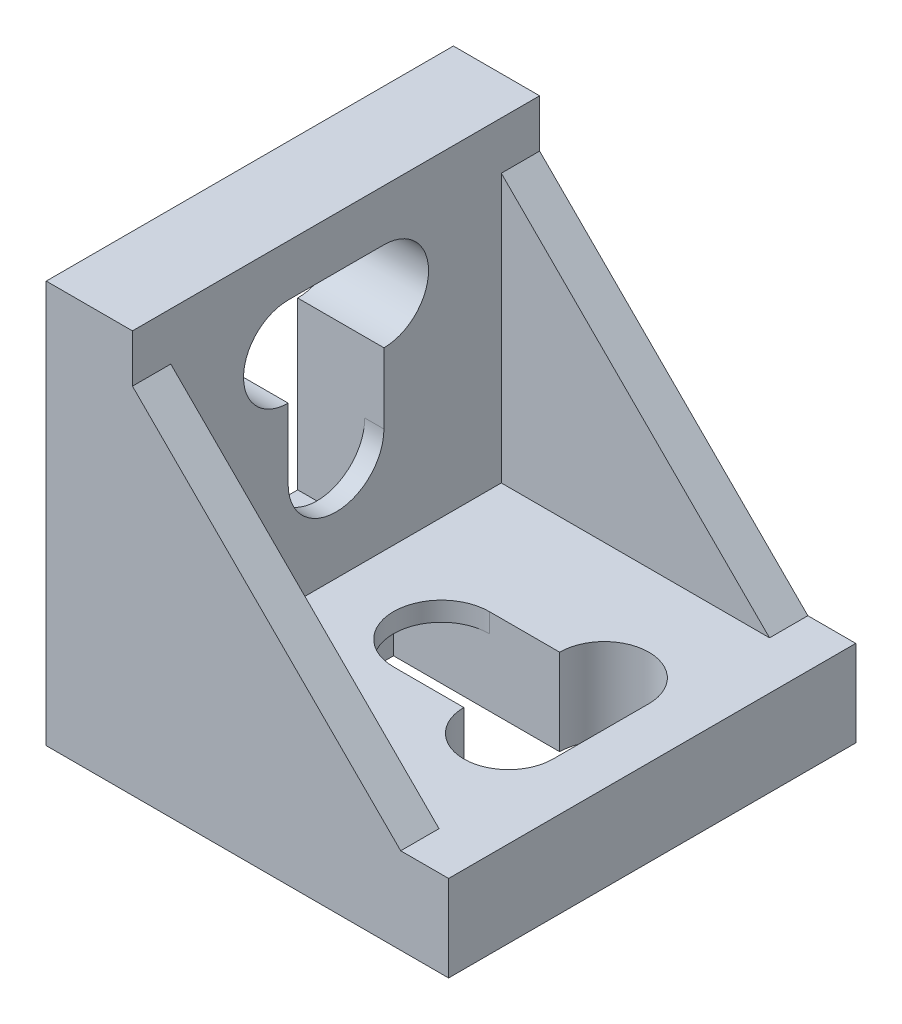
from build123d import *

# Parameters (mm, degrees)
EXTRUDE_1_DEPTH       = 21.25
EXTRUDE_2_DEPTH       = 4
CUT_EXTRUDE_1_DEPTH   = 64.083773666
CUT_EXTRUDE_2_DEPTH   = 64.083773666
CUT_EXTRUDE_3_DEPTH   = 7
SKETCH_6_W            = 10
SKETCH_6_H            = 13.671895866
CUT_EXTRUDE_4_DEPTH   = 7
SKETCH_7_W            = 7.8
SKETCH_7_H            = 2
EXTRUDE_3_DEPTH       = 2
MIRROR_7_COPY_1_DEPTH = 7
MIRROR_7_COPY_2_DEPTH = 7
CHAMFER_2_SIZE        = 4
CHAMFER_3_SIZE        = 4
CHAMFER_4_SIZE        = 4
CHAMFER_5_SIZE        = 4
EXTRUDE_5_REACH       = 73.332
EXTRUDE_6_DEPTH       = 9.5


with BuildPart() as part:
    # Sketch 1 → Extrude 1 (new, symmetric)
    with BuildSketch(Plane.XY):
        Polygon((0, 42), (9, 42), (9, 9), (42, 9), (42, 0), (0, 0), align=None)
    extrude(amount=EXTRUDE_1_DEPTH, both=True)

    # Sketch 2 → Extrude 2 (add)
    with BuildSketch(Plane.XY.offset(21.25)):
        Polygon((9, 37), (37, 9), (9, 9), align=None)
    extrude_2 = extrude(amount=-EXTRUDE_2_DEPTH)

    # Mirror 1: Extrude 2 across plane
    add(extrude_2.mirror(Plane.XY))

    # Sketch 3 → Cut-Extrude 1 (cut, through all)
    with BuildSketch(Plane.ZY):
        with BuildLine():
            Line((-5, 36.656208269), (5, 36.656208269))
            ThreePointArc((5, 36.656208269), (9.656208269, 32), (5, 27.343791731))
            Line((5, 27.343791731), (-5, 27.343791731))
            ThreePointArc((-5, 27.343791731), (-9.656208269, 32), (-5, 36.656208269))
        make_face()
    cut_extrude_1 = extrude(amount=-CUT_EXTRUDE_1_DEPTH, mode=Mode.SUBTRACT)

    # Sketch 4 → Cut-Extrude 2 (cut, through all)
    with BuildSketch(Plane.ZY):
        with BuildLine():
            Line((5, 30), (5, 20))
            ThreePointArc((5, 20), (0, 15), (-5, 20))
            Line((-5, 20), (-5, 30))
            ThreePointArc((-5, 30), (0, 35), (5, 30))
        make_face()
    cut_extrude_2 = extrude(amount=-CUT_EXTRUDE_2_DEPTH, mode=Mode.SUBTRACT)

    # Sketch 5 → Cut-Extrude 3 (cut)
    with BuildSketch(Plane.ZY):
        with BuildLine():
            Line((-8.75, 40), (-18.25, 40))
            Line((-18.25, 40), (-18.25, 5.338851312))
            Line((-18.25, 5.338851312), (-8.75, 5.338851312))
            Line((-8.75, 5.338851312), (-8.75, 25.504809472))
            ThreePointArc((-8.75, 25.504809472), (-12.5, 32), (-8.75, 38.495190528))
            Line((-8.75, 38.495190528), (-8.75, 40))
        make_face()
    cut_extrude_3 = extrude(amount=-CUT_EXTRUDE_3_DEPTH, mode=Mode.SUBTRACT)

    # Mirror 2: Cut-Extrude 3 across plane
    add(cut_extrude_3.mirror(Plane.XY), mode=Mode.SUBTRACT)

    # Sketch 6 → Cut-Extrude 4 (cut)
    with BuildSketch(Plane.ZY):
        with Locations((0, 16.835947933)):
            Rectangle(SKETCH_6_W, SKETCH_6_H)
    cut_extrude_4 = extrude(amount=-CUT_EXTRUDE_4_DEPTH, mode=Mode.SUBTRACT)

    # Sketch 7 → Extrude 3 (add)
    with BuildSketch(Plane.ZY):
        Polygon((0, 36.656208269), (4.218185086, 36.656208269), (4.218185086, 38.656208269), (-3.581814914, 38.656208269), (-3.581814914, 36.656208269), align=None)
        with Locations((0.318185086, 7.112457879)):
            Rectangle(SKETCH_7_W, SKETCH_7_H)
    extrude_3 = extrude(amount=EXTRUDE_3_DEPTH)

    # Mirror 3: Cut-Extrude 2 across plane
    add(cut_extrude_2.mirror(Plane(origin=(0, 0, 0), x_dir=(0, 0, 1), z_dir=(-0.7071067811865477, 0.7071067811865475, 0))), mode=Mode.SUBTRACT)

    # Mirror 4: Cut-Extrude 1 across plane
    add(cut_extrude_1.mirror(Plane(origin=(0, 0, 0), x_dir=(0, 0, 1), z_dir=(-0.7071067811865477, 0.7071067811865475, 0))), mode=Mode.SUBTRACT)

    # Mirror 5: Cut-Extrude 4 across plane
    add(cut_extrude_4.mirror(Plane(origin=(0, 0, 0), x_dir=(0, 0, 1), z_dir=(-0.7071067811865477, 0.7071067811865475, 0))), mode=Mode.SUBTRACT)

    # Mirror 6: Cut-Extrude 3 across plane
    add(cut_extrude_3.mirror(Plane(origin=(0, 0, 0), x_dir=(0, 0, 1), z_dir=(-0.7071067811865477, 0.7071067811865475, 0))), mode=Mode.SUBTRACT)

    # Mirror 7 copy 1 sketch → Mirror 7 copy 1 (cut)
    with BuildSketch(Plane(origin=(0, 0, 0), x_dir=(0, 0, -1), z_dir=(0, -1, 0))):
        with BuildLine():
            Line((-8.75, 40), (-18.25, 40))
            Line((-18.25, 40), (-18.25, 5.338851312))
            Line((-18.25, 5.338851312), (-8.75, 5.338851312))
            Line((-8.75, 5.338851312), (-8.75, 25.504809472))
            ThreePointArc((-8.75, 25.504809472), (-12.5, 32), (-8.75, 38.495190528))
            Line((-8.75, 38.495190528), (-8.75, 40))
        make_face()
    extrude(amount=-MIRROR_7_COPY_1_DEPTH, mode=Mode.SUBTRACT)

    # Mirror 7 copy 2 sketch → Mirror 7 copy 2 (cut)
    with BuildSketch(Plane(origin=(0, 0, 0), x_dir=(0, 0, 1), z_dir=(0, -1, 0))):
        with BuildLine():
            Line((-8.75, -40), (-18.25, -40))
            Line((-18.25, -40), (-18.25, -5.338851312))
            Line((-18.25, -5.338851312), (-8.75, -5.338851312))
            Line((-8.75, -5.338851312), (-8.75, -25.504809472))
            ThreePointArc((-8.75, -25.504809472), (-12.5, -32), (-8.75, -38.495190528))
            Line((-8.75, -38.495190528), (-8.75, -40))
        make_face()
    extrude(amount=-MIRROR_7_COPY_2_DEPTH, mode=Mode.SUBTRACT)

    # Mirror 8: Extrude 3 across plane
    add(extrude_3.mirror(Plane(origin=(0, 0, 0), x_dir=(0, 0, 1), z_dir=(-0.7071067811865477, 0.7071067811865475, 0))))

    # Chamfer 2
    chamfer_2_edges = [part.edges().sort_by_distance(p)[0] for p in [
        (5.338851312, 0, -13.5),
    ]]
    chamfer(chamfer_2_edges, length=CHAMFER_2_SIZE)

    # Chamfer 3
    chamfer_3_edges = [part.edges().sort_by_distance(p)[0] for p in [
        (5.338851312, 0, 13.5),
    ]]
    chamfer(chamfer_3_edges, length=CHAMFER_3_SIZE)

    # Chamfer 4
    chamfer_4_edges = [part.edges().sort_by_distance(p)[0] for p in [
        (0, 5.338851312, -13.5),
    ]]
    chamfer(chamfer_4_edges, length=CHAMFER_4_SIZE)

    # Chamfer 5
    chamfer_5_edges = [part.edges().sort_by_distance(p)[0] for p in [
        (0, 5.338851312, 13.5),
    ]]
    chamfer(chamfer_5_edges, length=CHAMFER_5_SIZE)

    # Sketch 11 → Extrude 5 (add, up to next)
    with BuildSketch(Plane(origin=(0, 0, 18.25), x_dir=(-1, 0, 0), z_dir=(0, 0, -1)), mode=Mode.PRIVATE) as extrude_5_sk1:
        Polygon((-8.338851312, 7), (-5.338851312, 4), (-5.338851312, 5.338851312), (-4, 5.338851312), (-7, 8.338851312), (-7, 7), align=None)
    extrude_5_tool1 = extrude(extrude_5_sk1.sketch, amount=EXTRUDE_5_REACH, mode=Mode.PRIVATE) - part.part
    add(extrude_5_tool1.solids().sort_by_distance((6.169426, 6.169426, 18.25))[0])

    # Sketch 12 → Extrude 6 (add)
    with BuildSketch(Plane(origin=(0, 0, -8.75), x_dir=(-1, 0, 0), z_dir=(0, 0, -1))):
        Polygon((-8.338851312, 7), (-5.338851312, 4), (-5.338851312, 5.338851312), (-4, 5.338851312), (-7, 8.338851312), (-7, 7), align=None)
    extrude(amount=EXTRUDE_6_DEPTH)


solid = part.part
